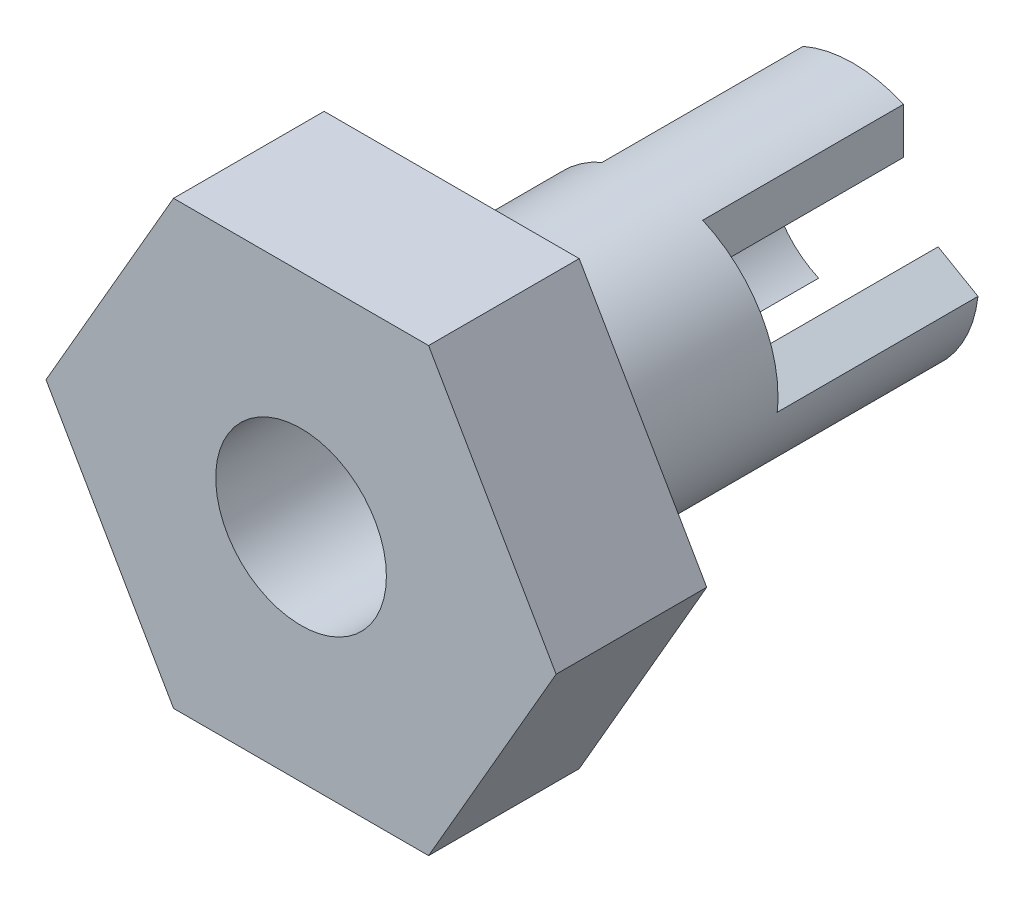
from build123d import *

# Parameters (mm, degrees)
BOSS_EXTRUDE1_DEPTH = 3.81
SKETCH3_R           = 2.159
CUT_EXTRUDE1_DEPTH  = 10.347522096
SKETCH5_R           = 3.175
SKETCH5_R_2         = 2.159
BOSS_EXTRUDE2_DEPTH = 5.08
BOSS_EXTRUDE3_DEPTH = 5.08


with BuildPart() as part:
    # Sketch1 → Boss-Extrude1 (new body)
    with BuildSketch(Plane.XY):
        Polygon((6.452466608, 0), (3.226233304, 5.588), (-3.226233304, 5.588), (-6.452466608, 0), (-3.226233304, -5.588), (3.226233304, -5.588), align=None)
    extrude(amount=BOSS_EXTRUDE1_DEPTH)

    # Sketch3 → Cut-Extrude1 (cut, through all)
    with BuildSketch(Plane.XY.offset(3.81)):
        Circle(SKETCH3_R)
    extrude(amount=-CUT_EXTRUDE1_DEPTH, mode=Mode.SUBTRACT)

    # Sketch5 → Boss-Extrude2 (add)
    with BuildSketch(Plane(origin=(0, 0, 0), x_dir=(-1, 0, 0), z_dir=(0, 0, -1))):
        with Locations(Location((0, 0, 0), (0, 0, 180))):
            Circle(SKETCH5_R)
        with Locations(Location((0, 0, 0), (0, 0, 180))):
            Circle(SKETCH5_R_2, mode=Mode.SUBTRACT)
    extrude(amount=BOSS_EXTRUDE2_DEPTH)

    # Sketch6 → Boss-Extrude3 (add)
    with BuildSketch(Plane(origin=(0, 0, -5.08), x_dir=(-1, 0, 0), z_dir=(0, 0, -1))):
        with BuildLine():
            Line((1.27, 2.909935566), (1.27, 1.74596134))
            ThreePointArc((1.27, 1.74596134), (0, 2.159), (-1.27, 1.74596134))
            Line((-1.27, 1.74596134), (-1.27, 2.909935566))
            ThreePointArc((-1.27, 2.909935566), (0, 3.175), (1.27, 2.909935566))
        make_face()
        with BuildLine():
            Line((3.155078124, -0.35511552), (2.147046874, 0.226871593))
            ThreePointArc((2.147046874, 0.226871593), (1.869748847, -1.0795), (0.877046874, -1.972832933))
            Line((0.877046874, -1.972832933), (1.885078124, -2.554820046))
            ThreePointArc((1.885078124, -2.554820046), (2.749630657, -1.5875), (3.155078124, -0.35511552))
        make_face()
        with BuildLine():
            Line((-1.885078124, -2.554820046), (-0.877046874, -1.972832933))
            ThreePointArc((-0.877046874, -1.972832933), (-1.869748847, -1.0795), (-2.147046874, 0.226871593))
            Line((-2.147046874, 0.226871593), (-3.155078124, -0.35511552))
            ThreePointArc((-3.155078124, -0.35511552), (-2.749630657, -1.5875), (-1.885078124, -2.554820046))
        make_face()
    extrude(amount=BOSS_EXTRUDE3_DEPTH)


solid = part.part
